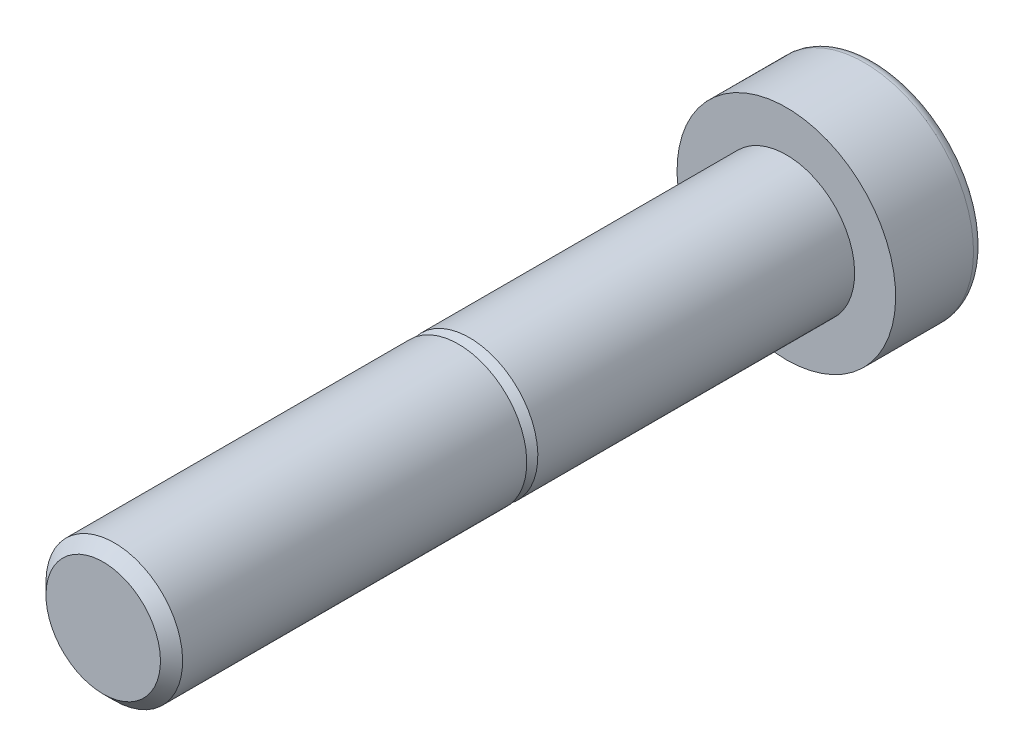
ISO-10303-21;
HEADER;
FILE_DESCRIPTION(('STEP AP214'),'2;1');
FILE_NAME('part.step','',(''),(''),'','','');
FILE_SCHEMA(('AUTOMOTIVE_DESIGN { 1 0 10303 214 1 1 1 1 }'));
ENDSEC;
DATA;
#1=APPLICATION_CONTEXT('core data for automotive mechanical design processes');
#2=APPLICATION_PROTOCOL_DEFINITION('international standard','automotive_design',2000,#1);
#3=PRODUCT_CONTEXT('',#1,'mechanical');
#4=PRODUCT('Part','Part','',(#3));
#5=PRODUCT_RELATED_PRODUCT_CATEGORY('part','',(#4));
#6=PRODUCT_DEFINITION_FORMATION('','',#4);
#7=PRODUCT_DEFINITION_CONTEXT('part definition',#1,'design');
#8=PRODUCT_DEFINITION('design','',#6,#7);
#9=PRODUCT_DEFINITION_SHAPE('','',#8);
#10=(LENGTH_UNIT() NAMED_UNIT(*) SI_UNIT(.MILLI.,.METRE.));
#11=(NAMED_UNIT(*) PLANE_ANGLE_UNIT() SI_UNIT($,.RADIAN.));
#12=(NAMED_UNIT(*) SI_UNIT($,.STERADIAN.) SOLID_ANGLE_UNIT());
#13=UNCERTAINTY_MEASURE_WITH_UNIT(LENGTH_MEASURE(1.E-05),#10,'distance_accuracy_value','');
#14=(GEOMETRIC_REPRESENTATION_CONTEXT(3) GLOBAL_UNCERTAINTY_ASSIGNED_CONTEXT((#13)) GLOBAL_UNIT_ASSIGNED_CONTEXT((#10,
#11,#12)) REPRESENTATION_CONTEXT('',''));
#15=CARTESIAN_POINT('',(0.,0.,0.));
#16=DIRECTION('',(0.,0.,1.));
#17=DIRECTION('',(1.,0.,0.));
#18=AXIS2_PLACEMENT_3D('',#15,#16,#17);
#19=CARTESIAN_POINT('',(4.61880215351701,0.,-3.15000009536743));
#20=DIRECTION('',(0.,0.,1.));
#21=DIRECTION('',(0.,-1.,0.));
#22=AXIS2_PLACEMENT_3D('',#19,#20,#21);
#23=PLANE('',#22);
#24=CARTESIAN_POINT('',(0.,0.,-3.15000009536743));
#25=DIRECTION('',(0.,0.,1.));
#26=DIRECTION('',(0.,-1.,0.));
#27=AXIS2_PLACEMENT_3D('',#24,#25,#26);
#28=CIRCLE('',#27,4.);
#29=CARTESIAN_POINT('',(0.,-4.,-3.15000009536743));
#30=VERTEX_POINT('',#29);
#31=CARTESIAN_POINT('',(-3.46410161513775,-2.,-3.15000009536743));
#32=VERTEX_POINT('',#31);
#33=EDGE_CURVE('E9',#30,#32,#28,.F.);
#34=ORIENTED_EDGE('',*,*,#33,.F.);
#35=DIRECTION('',(1.,0.,0.));
#36=VECTOR('',#35,1.);
#37=CARTESIAN_POINT('',(-2.30940107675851,-4.,-3.15000009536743));
#38=LINE('',#37,#36);
#39=CARTESIAN_POINT('',(-2.30940107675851,-4.,-3.15000009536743));
#40=VERTEX_POINT('',#39);
#41=EDGE_CURVE('E151',#40,#30,#38,.T.);
#42=ORIENTED_EDGE('',*,*,#41,.F.);
#43=DIRECTION('',(0.5,-0.866025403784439,0.));
#44=VECTOR('',#43,1.);
#45=CARTESIAN_POINT('',(-4.61880215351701,0.,-3.15000009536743));
#46=LINE('',#45,#44);
#47=EDGE_CURVE('E145',#32,#40,#46,.T.);
#48=ORIENTED_EDGE('',*,*,#47,.F.);
#49=EDGE_LOOP('',(#34,#42,#48));
#50=FACE_BOUND('',#49,.T.);
#51=ADVANCED_FACE('F14',(#50),#23,.F.);
#52=CARTESIAN_POINT('',(-3.46410161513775,2.,-3.15000009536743));
#53=VERTEX_POINT('',#52);
#54=EDGE_CURVE('E23',#32,#53,#28,.F.);
#55=ORIENTED_EDGE('',*,*,#54,.F.);
#56=CARTESIAN_POINT('',(-4.61880215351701,0.,-3.15000009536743));
#57=VERTEX_POINT('',#56);
#58=EDGE_CURVE('E146',#57,#32,#46,.T.);
#59=ORIENTED_EDGE('',*,*,#58,.F.);
#60=DIRECTION('',(-0.5,-0.866025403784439,0.));
#61=VECTOR('',#60,1.);
#62=CARTESIAN_POINT('',(-2.3094010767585,4.,-3.15000009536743));
#63=LINE('',#62,#61);
#64=EDGE_CURVE('E140',#53,#57,#63,.T.);
#65=ORIENTED_EDGE('',*,*,#64,.F.);
#66=EDGE_LOOP('',(#55,#59,#65));
#67=FACE_BOUND('',#66,.T.);
#68=ADVANCED_FACE('F244',(#67),#23,.F.);
#69=CARTESIAN_POINT('',(0.,4.,-3.15000009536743));
#70=VERTEX_POINT('',#69);
#71=EDGE_CURVE('E222',#53,#70,#28,.F.);
#72=ORIENTED_EDGE('',*,*,#71,.F.);
#73=CARTESIAN_POINT('',(-2.3094010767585,4.,-3.15000009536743));
#74=VERTEX_POINT('',#73);
#75=EDGE_CURVE('E141',#74,#53,#63,.T.);
#76=ORIENTED_EDGE('',*,*,#75,.F.);
#77=DIRECTION('',(-1.,0.,0.));
#78=VECTOR('',#77,1.);
#79=CARTESIAN_POINT('',(2.30940107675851,4.,-3.15000009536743));
#80=LINE('',#79,#78);
#81=EDGE_CURVE('E134',#70,#74,#80,.T.);
#82=ORIENTED_EDGE('',*,*,#81,.F.);
#83=EDGE_LOOP('',(#72,#76,#82));
#84=FACE_BOUND('',#83,.T.);
#85=ADVANCED_FACE('F243',(#84),#23,.F.);
#86=CARTESIAN_POINT('',(3.46410161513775,2.,-3.15000009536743));
#87=VERTEX_POINT('',#86);
#88=EDGE_CURVE('E218',#70,#87,#28,.F.);
#89=ORIENTED_EDGE('',*,*,#88,.F.);
#90=CARTESIAN_POINT('',(2.30940107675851,4.,-3.15000009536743));
#91=VERTEX_POINT('',#90);
#92=EDGE_CURVE('E136',#91,#70,#80,.T.);
#93=ORIENTED_EDGE('',*,*,#92,.F.);
#94=DIRECTION('',(-0.5,0.866025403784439,0.));
#95=VECTOR('',#94,1.);
#96=CARTESIAN_POINT('',(4.61880215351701,0.,-3.15000009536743));
#97=LINE('',#96,#95);
#98=EDGE_CURVE('E135',#87,#91,#97,.T.);
#99=ORIENTED_EDGE('',*,*,#98,.F.);
#100=EDGE_LOOP('',(#89,#93,#99));
#101=FACE_BOUND('',#100,.T.);
#102=ADVANCED_FACE('F275',(#101),#23,.F.);
#103=CARTESIAN_POINT('',(3.46410161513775,-2.,-3.15000009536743));
#104=VERTEX_POINT('',#103);
#105=EDGE_CURVE('E24',#87,#104,#28,.F.);
#106=ORIENTED_EDGE('',*,*,#105,.F.);
#107=CARTESIAN_POINT('',(4.61880215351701,0.,-3.15000009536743));
#108=VERTEX_POINT('',#107);
#109=EDGE_CURVE('E130',#108,#87,#97,.T.);
#110=ORIENTED_EDGE('',*,*,#109,.F.);
#111=DIRECTION('',(0.5,0.866025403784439,0.));
#112=VECTOR('',#111,1.);
#113=CARTESIAN_POINT('',(2.3094010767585,-4.,-3.15000009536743));
#114=LINE('',#113,#112);
#115=EDGE_CURVE('E129',#104,#108,#114,.T.);
#116=ORIENTED_EDGE('',*,*,#115,.F.);
#117=EDGE_LOOP('',(#106,#110,#116));
#118=FACE_BOUND('',#117,.T.);
#119=ADVANCED_FACE('F270',(#118),#23,.F.);
#120=CARTESIAN_POINT('',(0.,0.,-3.15000009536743));
#121=DIRECTION('',(0.,0.,1.));
#122=DIRECTION('',(0.,-1.,0.));
#123=AXIS2_PLACEMENT_3D('',#120,#121,#122);
#124=CIRCLE('',#123,4.);
#125=EDGE_CURVE('E110',#30,#104,#124,.T.);
#126=ORIENTED_EDGE('',*,*,#125,.T.);
#127=CARTESIAN_POINT('',(2.3094010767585,-4.,-3.15000009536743));
#128=VERTEX_POINT('',#127);
#129=EDGE_CURVE('E155',#128,#104,#114,.T.);
#130=ORIENTED_EDGE('',*,*,#129,.F.);
#131=EDGE_CURVE('E150',#30,#128,#38,.T.);
#132=ORIENTED_EDGE('',*,*,#131,.F.);
#133=EDGE_LOOP('',(#126,#130,#132));
#134=FACE_BOUND('',#133,.T.);
#135=ADVANCED_FACE('F283',(#134),#23,.F.);
#136=CARTESIAN_POINT('',(0.,0.,0.));
#137=DIRECTION('',(0.,0.,-1.));
#138=DIRECTION('',(0.,-1.,0.));
#139=AXIS2_PLACEMENT_3D('',#136,#137,#138);
#140=PLANE('',#139);
#141=CARTESIAN_POINT('',(0.,0.,0.));
#142=DIRECTION('',(0.,0.,-1.));
#143=DIRECTION('',(0.,-1.,0.));
#144=AXIS2_PLACEMENT_3D('',#141,#142,#143);
#145=CIRCLE('',#144,8.);
#146=CARTESIAN_POINT('',(0.,-8.,0.));
#147=VERTEX_POINT('',#146);
#148=EDGE_CURVE('E189',#147,#147,#145,.T.);
#149=ORIENTED_EDGE('',*,*,#148,.F.);
#150=EDGE_LOOP('',(#149));
#151=FACE_BOUND('',#150,.T.);
#152=CARTESIAN_POINT('',(0.,0.,0.));
#153=DIRECTION('',(0.,0.,-1.));
#154=DIRECTION('',(0.,-1.,0.));
#155=AXIS2_PLACEMENT_3D('',#152,#153,#154);
#156=CIRCLE('',#155,5.);
#157=CARTESIAN_POINT('',(0.,-5.,0.));
#158=VERTEX_POINT('',#157);
#159=EDGE_CURVE('E210',#158,#158,#156,.F.);
#160=ORIENTED_EDGE('',*,*,#159,.F.);
#161=EDGE_LOOP('',(#160));
#162=FACE_BOUND('',#161,.T.);
#163=ADVANCED_FACE('F292',(#151,#162),#140,.F.);
#164=CARTESIAN_POINT('',(-7.2,0.,-6.5));
#165=DIRECTION('',(0.,0.,1.));
#166=DIRECTION('',(0.,1.,0.));
#167=AXIS2_PLACEMENT_3D('',#164,#165,#166);
#168=PLANE('',#167);
#169=CARTESIAN_POINT('',(0.,0.,-6.5));
#170=DIRECTION('',(0.,0.,-1.));
#171=DIRECTION('',(0.,-1.,0.));
#172=AXIS2_PLACEMENT_3D('',#169,#170,#171);
#173=CIRCLE('',#172,7.2);
#174=CARTESIAN_POINT('',(0.,-7.2,-6.5));
#175=VERTEX_POINT('',#174);
#176=EDGE_CURVE('E181',#175,#175,#173,.T.);
#177=ORIENTED_EDGE('',*,*,#176,.T.);
#178=EDGE_LOOP('',(#177));
#179=FACE_BOUND('',#178,.T.);
#180=DIRECTION('',(-0.5,-0.866025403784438,0.));
#181=VECTOR('',#180,1.);
#182=CARTESIAN_POINT('',(1.66410161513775,-5.11769145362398,-6.5));
#183=LINE('',#182,#181);
#184=CARTESIAN_POINT('',(4.61880215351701,0.,-6.5));
#185=VERTEX_POINT('',#184);
#186=CARTESIAN_POINT('',(2.3094010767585,-4.,-6.5));
#187=VERTEX_POINT('',#186);
#188=EDGE_CURVE('E208',#185,#187,#183,.T.);
#189=ORIENTED_EDGE('',*,*,#188,.F.);
#190=DIRECTION('',(0.5,-0.866025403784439,0.));
#191=VECTOR('',#190,1.);
#192=CARTESIAN_POINT('',(1.66410161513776,5.11769145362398,-6.5));
#193=LINE('',#192,#191);
#194=CARTESIAN_POINT('',(2.30940107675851,4.,-6.5));
#195=VERTEX_POINT('',#194);
#196=EDGE_CURVE('E205',#195,#185,#193,.T.);
#197=ORIENTED_EDGE('',*,*,#196,.F.);
#198=DIRECTION('',(1.,0.,0.));
#199=VECTOR('',#198,1.);
#200=CARTESIAN_POINT('',(-7.2,4.,-6.5));
#201=LINE('',#200,#199);
#202=CARTESIAN_POINT('',(-2.3094010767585,4.,-6.5));
#203=VERTEX_POINT('',#202);
#204=EDGE_CURVE('E202',#203,#195,#201,.T.);
#205=ORIENTED_EDGE('',*,*,#204,.F.);
#206=DIRECTION('',(0.5,0.866025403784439,0.));
#207=VECTOR('',#206,1.);
#208=CARTESIAN_POINT('',(-5.26410161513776,-1.11769145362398,-6.5));
#209=LINE('',#208,#207);
#210=CARTESIAN_POINT('',(-4.61880215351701,0.,-6.5));
#211=VERTEX_POINT('',#210);
#212=EDGE_CURVE('E199',#211,#203,#209,.T.);
#213=ORIENTED_EDGE('',*,*,#212,.F.);
#214=DIRECTION('',(-0.5,0.866025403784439,0.));
#215=VECTOR('',#214,1.);
#216=CARTESIAN_POINT('',(-5.26410161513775,1.11769145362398,-6.5));
#217=LINE('',#216,#215);
#218=CARTESIAN_POINT('',(-2.30940107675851,-4.,-6.5));
#219=VERTEX_POINT('',#218);
#220=EDGE_CURVE('E196',#219,#211,#217,.T.);
#221=ORIENTED_EDGE('',*,*,#220,.F.);
#222=DIRECTION('',(-1.,0.,0.));
#223=VECTOR('',#222,1.);
#224=CARTESIAN_POINT('',(-7.2,-4.,-6.5));
#225=LINE('',#224,#223);
#226=EDGE_CURVE('E193',#187,#219,#225,.T.);
#227=ORIENTED_EDGE('',*,*,#226,.F.);
#228=EDGE_LOOP('',(#189,#197,#205,#213,#221,#227));
#229=FACE_BOUND('',#228,.T.);
#230=ADVANCED_FACE('F16',(#179,#229),#168,.F.);
#231=CARTESIAN_POINT('',(0.,0.,-6.5));
#232=DIRECTION('',(0.,0.,-1.));
#233=DIRECTION('',(0.,-1.,0.));
#234=AXIS2_PLACEMENT_3D('',#231,#232,#233);
#235=CYLINDRICAL_SURFACE('',#234,8.);
#236=CARTESIAN_POINT('',(0.,0.,-5.7));
#237=DIRECTION('',(0.,0.,-1.));
#238=DIRECTION('',(0.,-1.,0.));
#239=AXIS2_PLACEMENT_3D('',#236,#237,#238);
#240=CIRCLE('',#239,8.);
#241=CARTESIAN_POINT('',(0.,-8.,-5.7));
#242=VERTEX_POINT('',#241);
#243=EDGE_CURVE('E185',#242,#242,#240,.T.);
#244=ORIENTED_EDGE('',*,*,#243,.F.);
#245=EDGE_LOOP('',(#244));
#246=FACE_BOUND('',#245,.T.);
#247=ORIENTED_EDGE('',*,*,#148,.T.);
#248=EDGE_LOOP('',(#247));
#249=FACE_BOUND('',#248,.T.);
#250=ADVANCED_FACE('F326',(#246,#249),#235,.T.);
#251=CARTESIAN_POINT('',(0.,0.,-5.7));
#252=DIRECTION('',(0.,0.,-1.));
#253=DIRECTION('',(0.,-1.,0.));
#254=AXIS2_PLACEMENT_3D('',#251,#252,#253);
#255=TOROIDAL_SURFACE('',#254,7.2,0.8);
#256=ORIENTED_EDGE('',*,*,#176,.F.);
#257=EDGE_LOOP('',(#256));
#258=FACE_BOUND('',#257,.T.);
#259=ORIENTED_EDGE('',*,*,#243,.T.);
#260=EDGE_LOOP('',(#259));
#261=FACE_BOUND('',#260,.T.);
#262=ADVANCED_FACE('F335',(#258,#261),#255,.T.);
#263=CARTESIAN_POINT('',(2.3094010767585,-4.,-3.15000009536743));
#264=DIRECTION('',(-0.866025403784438,0.5,0.));
#265=DIRECTION('',(-0.5,-0.866025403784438,0.));
#266=AXIS2_PLACEMENT_3D('',#263,#264,#265);
#267=PLANE('',#266);
#268=ORIENTED_EDGE('',*,*,#188,.T.);
#269=DIRECTION('',(0.,0.,-1.));
#270=VECTOR('',#269,1.);
#271=CARTESIAN_POINT('',(2.3094010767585,-4.,-3.15000009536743));
#272=LINE('',#271,#270);
#273=EDGE_CURVE('E38',#128,#187,#272,.T.);
#274=ORIENTED_EDGE('',*,*,#273,.F.);
#275=ORIENTED_EDGE('',*,*,#129,.T.);
#276=ORIENTED_EDGE('',*,*,#115,.T.);
#277=DIRECTION('',(0.,0.,-1.));
#278=VECTOR('',#277,1.);
#279=CARTESIAN_POINT('',(4.61880215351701,0.,-3.15000009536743));
#280=LINE('',#279,#278);
#281=EDGE_CURVE('E177',#108,#185,#280,.T.);
#282=ORIENTED_EDGE('',*,*,#281,.T.);
#283=EDGE_LOOP('',(#268,#274,#275,#276,#282));
#284=FACE_BOUND('',#283,.T.);
#285=ADVANCED_FACE('F264',(#284),#267,.T.);
#286=CARTESIAN_POINT('',(4.61880215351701,0.,-3.15000009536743));
#287=DIRECTION('',(-0.866025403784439,-0.5,0.));
#288=DIRECTION('',(0.5,-0.866025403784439,0.));
#289=AXIS2_PLACEMENT_3D('',#286,#287,#288);
#290=PLANE('',#289);
#291=ORIENTED_EDGE('',*,*,#196,.T.);
#292=ORIENTED_EDGE('',*,*,#281,.F.);
#293=ORIENTED_EDGE('',*,*,#109,.T.);
#294=ORIENTED_EDGE('',*,*,#98,.T.);
#295=DIRECTION('',(0.,0.,-1.));
#296=VECTOR('',#295,1.);
#297=CARTESIAN_POINT('',(2.30940107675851,4.,-3.15000009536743));
#298=LINE('',#297,#296);
#299=EDGE_CURVE('E173',#91,#195,#298,.T.);
#300=ORIENTED_EDGE('',*,*,#299,.T.);
#301=EDGE_LOOP('',(#291,#292,#293,#294,#300));
#302=FACE_BOUND('',#301,.T.);
#303=ADVANCED_FACE('F262',(#302),#290,.T.);
#304=CARTESIAN_POINT('',(2.30940107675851,4.,-3.15000009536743));
#305=DIRECTION('',(0.,-1.,0.));
#306=DIRECTION('',(1.,0.,0.));
#307=AXIS2_PLACEMENT_3D('',#304,#305,#306);
#308=PLANE('',#307);
#309=ORIENTED_EDGE('',*,*,#204,.T.);
#310=ORIENTED_EDGE('',*,*,#299,.F.);
#311=ORIENTED_EDGE('',*,*,#92,.T.);
#312=ORIENTED_EDGE('',*,*,#81,.T.);
#313=DIRECTION('',(0.,0.,-1.));
#314=VECTOR('',#313,1.);
#315=CARTESIAN_POINT('',(-2.3094010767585,4.,-3.15000009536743));
#316=LINE('',#315,#314);
#317=EDGE_CURVE('E169',#74,#203,#316,.T.);
#318=ORIENTED_EDGE('',*,*,#317,.T.);
#319=EDGE_LOOP('',(#309,#310,#311,#312,#318));
#320=FACE_BOUND('',#319,.T.);
#321=ADVANCED_FACE('F253',(#320),#308,.T.);
#322=CARTESIAN_POINT('',(-2.3094010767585,4.,-3.15000009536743));
#323=DIRECTION('',(0.866025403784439,-0.5,0.));
#324=DIRECTION('',(0.5,0.866025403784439,0.));
#325=AXIS2_PLACEMENT_3D('',#322,#323,#324);
#326=PLANE('',#325);
#327=ORIENTED_EDGE('',*,*,#212,.T.);
#328=ORIENTED_EDGE('',*,*,#317,.F.);
#329=ORIENTED_EDGE('',*,*,#75,.T.);
#330=ORIENTED_EDGE('',*,*,#64,.T.);
#331=DIRECTION('',(0.,0.,-1.));
#332=VECTOR('',#331,1.);
#333=CARTESIAN_POINT('',(-4.61880215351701,0.,-3.15000009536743));
#334=LINE('',#333,#332);
#335=EDGE_CURVE('E165',#57,#211,#334,.T.);
#336=ORIENTED_EDGE('',*,*,#335,.T.);
#337=EDGE_LOOP('',(#327,#328,#329,#330,#336));
#338=FACE_BOUND('',#337,.T.);
#339=ADVANCED_FACE('F249',(#338),#326,.T.);
#340=CARTESIAN_POINT('',(-4.61880215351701,0.,-3.15000009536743));
#341=DIRECTION('',(0.866025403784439,0.5,0.));
#342=DIRECTION('',(-0.5,0.866025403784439,0.));
#343=AXIS2_PLACEMENT_3D('',#340,#341,#342);
#344=PLANE('',#343);
#345=ORIENTED_EDGE('',*,*,#220,.T.);
#346=ORIENTED_EDGE('',*,*,#335,.F.);
#347=ORIENTED_EDGE('',*,*,#58,.T.);
#348=ORIENTED_EDGE('',*,*,#47,.T.);
#349=DIRECTION('',(0.,0.,-1.));
#350=VECTOR('',#349,1.);
#351=CARTESIAN_POINT('',(-2.30940107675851,-4.,-3.15000009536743));
#352=LINE('',#351,#350);
#353=EDGE_CURVE('E161',#40,#219,#352,.T.);
#354=ORIENTED_EDGE('',*,*,#353,.T.);
#355=EDGE_LOOP('',(#345,#346,#347,#348,#354));
#356=FACE_BOUND('',#355,.T.);
#357=ADVANCED_FACE('F378',(#356),#344,.T.);
#358=CARTESIAN_POINT('',(-2.30940107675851,-4.,-3.15000009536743));
#359=DIRECTION('',(0.,1.,0.));
#360=DIRECTION('',(-1.,0.,0.));
#361=AXIS2_PLACEMENT_3D('',#358,#359,#360);
#362=PLANE('',#361);
#363=ORIENTED_EDGE('',*,*,#226,.T.);
#364=ORIENTED_EDGE('',*,*,#353,.F.);
#365=ORIENTED_EDGE('',*,*,#41,.T.);
#366=ORIENTED_EDGE('',*,*,#131,.T.);
#367=ORIENTED_EDGE('',*,*,#273,.T.);
#368=EDGE_LOOP('',(#363,#364,#365,#366,#367));
#369=FACE_BOUND('',#368,.T.);
#370=ADVANCED_FACE('F387',(#369),#362,.T.);
#371=CARTESIAN_POINT('',(0.,0.,0.));
#372=DIRECTION('',(0.,0.,-1.));
#373=DIRECTION('',(0.,-1.,0.));
#374=AXIS2_PLACEMENT_3D('',#371,#372,#373);
#375=CYLINDRICAL_SURFACE('',#374,5.);
#376=CARTESIAN_POINT('',(0.,0.,23.1882132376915));
#377=DIRECTION('',(0.,0.,-1.));
#378=DIRECTION('',(0.,-1.,0.));
#379=AXIS2_PLACEMENT_3D('',#376,#377,#378);
#380=CIRCLE('',#379,5.);
#381=CARTESIAN_POINT('',(0.,-5.,23.1882132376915));
#382=VERTEX_POINT('',#381);
#383=EDGE_CURVE('E97',#382,#382,#380,.T.);
#384=ORIENTED_EDGE('',*,*,#383,.T.);
#385=EDGE_LOOP('',(#384));
#386=FACE_BOUND('',#385,.T.);
#387=ORIENTED_EDGE('',*,*,#159,.T.);
#388=EDGE_LOOP('',(#387));
#389=FACE_BOUND('',#388,.T.);
#390=ADVANCED_FACE('F397',(#386,#389),#375,.T.);
#391=CARTESIAN_POINT('',(0.,0.,50.));
#392=DIRECTION('',(0.,0.,-1.));
#393=DIRECTION('',(0.,-1.,0.));
#394=AXIS2_PLACEMENT_3D('',#391,#392,#393);
#395=PLANE('',#394);
#396=CARTESIAN_POINT('',(0.,0.,50.));
#397=DIRECTION('',(0.,0.,-1.));
#398=DIRECTION('',(0.,-1.,0.));
#399=AXIS2_PLACEMENT_3D('',#396,#397,#398);
#400=CIRCLE('',#399,4.18821323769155);
#401=CARTESIAN_POINT('',(0.,-4.18821323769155,50.));
#402=VERTEX_POINT('',#401);
#403=EDGE_CURVE('E125',#402,#402,#400,.T.);
#404=ORIENTED_EDGE('',*,*,#403,.F.);
#405=EDGE_LOOP('',(#404));
#406=FACE_BOUND('',#405,.T.);
#407=ADVANCED_FACE('F405',(#406),#395,.F.);
#408=CARTESIAN_POINT('',(0.,0.,50.));
#409=DIRECTION('',(0.,0.,-1.));
#410=DIRECTION('',(0.,-1.,0.));
#411=AXIS2_PLACEMENT_3D('',#408,#409,#410);
#412=CONICAL_SURFACE('',#411,4.18821323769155,0.78539816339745);
#413=CARTESIAN_POINT('',(0.,0.,49.1882132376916));
#414=DIRECTION('',(0.,0.,-1.));
#415=DIRECTION('',(0.,-1.,0.));
#416=AXIS2_PLACEMENT_3D('',#413,#414,#415);
#417=CIRCLE('',#416,5.);
#418=CARTESIAN_POINT('',(0.,-5.,49.1882132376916));
#419=VERTEX_POINT('',#418);
#420=EDGE_CURVE('E121',#419,#419,#417,.T.);
#421=ORIENTED_EDGE('',*,*,#420,.F.);
#422=EDGE_LOOP('',(#421));
#423=FACE_BOUND('',#422,.T.);
#424=ORIENTED_EDGE('',*,*,#403,.T.);
#425=EDGE_LOOP('',(#424));
#426=FACE_BOUND('',#425,.T.);
#427=ADVANCED_FACE('F415',(#423,#426),#412,.T.);
#428=CARTESIAN_POINT('',(0.,0.,0.));
#429=DIRECTION('',(0.,0.,-1.));
#430=DIRECTION('',(0.,-1.,0.));
#431=AXIS2_PLACEMENT_3D('',#428,#429,#430);
#432=CYLINDRICAL_SURFACE('',#431,5.);
#433=CARTESIAN_POINT('',(0.,0.,24.));
#434=DIRECTION('',(0.,0.,-1.));
#435=DIRECTION('',(0.,-1.,0.));
#436=AXIS2_PLACEMENT_3D('',#433,#434,#435);
#437=CIRCLE('',#436,5.);
#438=CARTESIAN_POINT('',(0.,-5.,24.));
#439=VERTEX_POINT('',#438);
#440=EDGE_CURVE('E117',#439,#439,#437,.T.);
#441=ORIENTED_EDGE('',*,*,#440,.F.);
#442=EDGE_LOOP('',(#441));
#443=FACE_BOUND('',#442,.T.);
#444=ORIENTED_EDGE('',*,*,#420,.T.);
#445=EDGE_LOOP('',(#444));
#446=FACE_BOUND('',#445,.T.);
#447=ADVANCED_FACE('F424',(#443,#446),#432,.T.);
#448=CARTESIAN_POINT('',(-5.,0.,24.));
#449=DIRECTION('',(0.,0.,1.));
#450=DIRECTION('',(0.,1.,0.));
#451=AXIS2_PLACEMENT_3D('',#448,#449,#450);
#452=PLANE('',#451);
#453=CARTESIAN_POINT('',(0.,0.,24.));
#454=DIRECTION('',(0.,0.,-1.));
#455=DIRECTION('',(0.,-1.,0.));
#456=AXIS2_PLACEMENT_3D('',#453,#454,#455);
#457=CIRCLE('',#456,4.18821323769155);
#458=CARTESIAN_POINT('',(0.,-4.18821323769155,24.));
#459=VERTEX_POINT('',#458);
#460=EDGE_CURVE('E106',#459,#459,#457,.T.);
#461=ORIENTED_EDGE('',*,*,#460,.F.);
#462=EDGE_LOOP('',(#461));
#463=FACE_BOUND('',#462,.T.);
#464=ORIENTED_EDGE('',*,*,#440,.T.);
#465=EDGE_LOOP('',(#464));
#466=FACE_BOUND('',#465,.T.);
#467=ADVANCED_FACE('F434',(#463,#466),#452,.F.);
#468=CARTESIAN_POINT('',(0.,0.,24.));
#469=DIRECTION('',(0.,0.,-1.));
#470=DIRECTION('',(0.,-1.,0.));
#471=AXIS2_PLACEMENT_3D('',#468,#469,#470);
#472=CONICAL_SURFACE('',#471,4.18821323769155,0.785398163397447);
#473=ORIENTED_EDGE('',*,*,#383,.F.);
#474=EDGE_LOOP('',(#473));
#475=FACE_BOUND('',#474,.T.);
#476=ORIENTED_EDGE('',*,*,#460,.T.);
#477=EDGE_LOOP('',(#476));
#478=FACE_BOUND('',#477,.T.);
#479=ADVANCED_FACE('F90',(#475,#478),#472,.T.);
#480=CARTESIAN_POINT('',(0.,0.,-0.57337588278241));
#481=DIRECTION('',(0.,0.,-1.));
#482=DIRECTION('',(0.,1.,0.));
#483=AXIS2_PLACEMENT_3D('',#480,#481,#482);
#484=CONICAL_SURFACE('',#483,2.5,1.0471975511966);
#485=CARTESIAN_POINT('',(0.,0.,0.869999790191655));
#486=VERTEX_POINT('',#485);
#487=VERTEX_LOOP('',#486);
#488=FACE_BOUND('',#487,.T.);
#489=CARTESIAN_POINT('',(0.,0.,-0.57337588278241));
#490=DIRECTION('',(0.,0.,1.));
#491=DIRECTION('',(0.,-1.,0.));
#492=AXIS2_PLACEMENT_3D('',#489,#490,#491);
#493=CIRCLE('',#492,2.5);
#494=CARTESIAN_POINT('',(0.,-2.5,-0.57337588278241));
#495=VERTEX_POINT('',#494);
#496=EDGE_CURVE('E94',#495,#495,#493,.T.);
#497=ORIENTED_EDGE('',*,*,#496,.F.);
#498=EDGE_LOOP('',(#497));
#499=FACE_BOUND('',#498,.T.);
#500=ADVANCED_FACE('F86',(#488,#499),#484,.F.);
#501=CARTESIAN_POINT('',(0.,0.,-4.15000009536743));
#502=DIRECTION('',(0.,0.,1.));
#503=DIRECTION('',(0.,-1.,0.));
#504=AXIS2_PLACEMENT_3D('',#501,#502,#503);
#505=CYLINDRICAL_SURFACE('',#504,2.5);
#506=ORIENTED_EDGE('',*,*,#496,.T.);
#507=EDGE_LOOP('',(#506));
#508=FACE_BOUND('',#507,.T.);
#509=CARTESIAN_POINT('',(0.,0.,-2.28397469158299));
#510=DIRECTION('',(0.,0.,1.));
#511=DIRECTION('',(0.,-1.,0.));
#512=AXIS2_PLACEMENT_3D('',#509,#510,#511);
#513=CIRCLE('',#512,2.5);
#514=CARTESIAN_POINT('',(0.,-2.5,-2.28397469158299));
#515=VERTEX_POINT('',#514);
#516=EDGE_CURVE('E98',#515,#515,#513,.T.);
#517=ORIENTED_EDGE('',*,*,#516,.F.);
#518=EDGE_LOOP('',(#517));
#519=FACE_BOUND('',#518,.T.);
#520=ADVANCED_FACE('F89',(#508,#519),#505,.F.);
#521=CARTESIAN_POINT('',(0.,0.,-3.15000009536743));
#522=DIRECTION('',(0.,0.,-1.));
#523=DIRECTION('',(0.,1.,0.));
#524=AXIS2_PLACEMENT_3D('',#521,#522,#523);
#525=CONICAL_SURFACE('',#524,4.,1.0471975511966);
#526=ORIENTED_EDGE('',*,*,#516,.T.);
#527=EDGE_LOOP('',(#526));
#528=FACE_BOUND('',#527,.T.);
#529=ORIENTED_EDGE('',*,*,#125,.F.);
#530=ORIENTED_EDGE('',*,*,#33,.T.);
#531=ORIENTED_EDGE('',*,*,#54,.T.);
#532=ORIENTED_EDGE('',*,*,#71,.T.);
#533=ORIENTED_EDGE('',*,*,#88,.T.);
#534=ORIENTED_EDGE('',*,*,#105,.T.);
#535=EDGE_LOOP('',(#529,#530,#531,#532,#533,#534));
#536=FACE_BOUND('',#535,.T.);
#537=ADVANCED_FACE('F234',(#528,#536),#525,.F.);
#538=CLOSED_SHELL('',(#51,#68,#85,#102,#119,#135,#163,#230,#250,#262,#285,#303,#321,#339,#357,
#370,#390,#407,#427,#447,#467,#479,#500,#520,#537));
#539=MANIFOLD_SOLID_BREP('B1',#538);
#540=ADVANCED_BREP_SHAPE_REPRESENTATION('',(#18,#539),#14);
#541=SHAPE_DEFINITION_REPRESENTATION(#9,#540);
ENDSEC;
END-ISO-10303-21;
